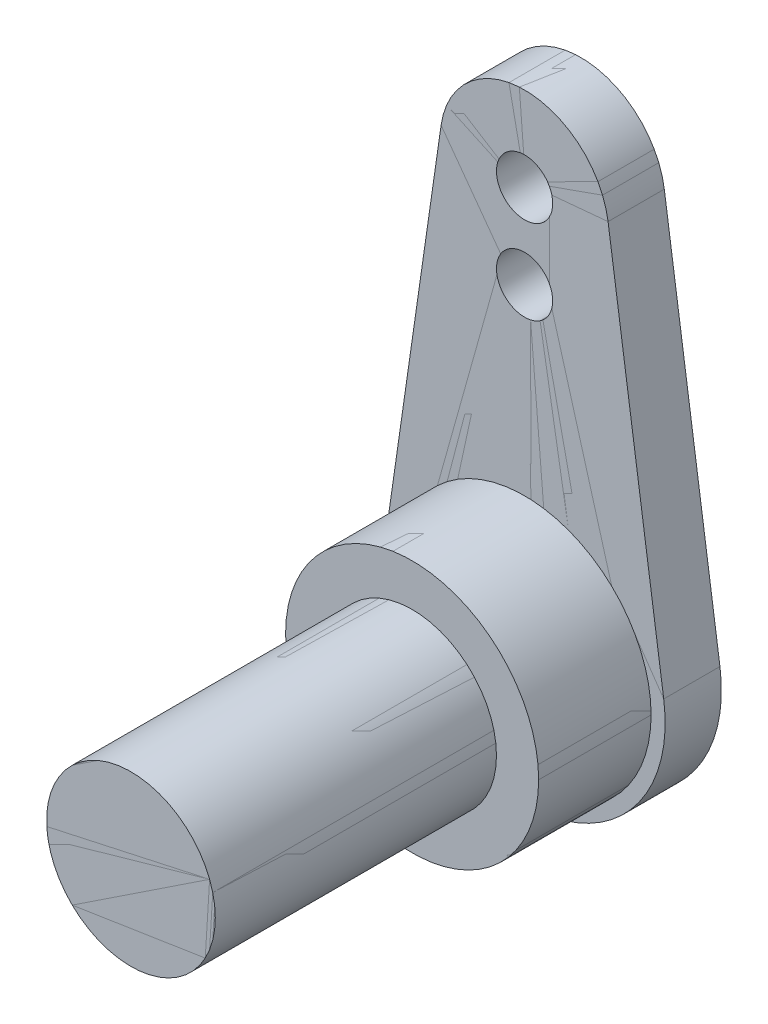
ISO-10303-21;
HEADER;
FILE_DESCRIPTION(('STEP AP214'),'2;1');
FILE_NAME('part.step','',(''),(''),'','','');
FILE_SCHEMA(('AUTOMOTIVE_DESIGN { 1 0 10303 214 1 1 1 1 }'));
ENDSEC;
DATA;
#1=APPLICATION_CONTEXT('core data for automotive mechanical design processes');
#2=APPLICATION_PROTOCOL_DEFINITION('international standard','automotive_design',2000,#1);
#3=PRODUCT_CONTEXT('',#1,'mechanical');
#4=PRODUCT('Part','Part','',(#3));
#5=PRODUCT_RELATED_PRODUCT_CATEGORY('part','',(#4));
#6=PRODUCT_DEFINITION_FORMATION('','',#4);
#7=PRODUCT_DEFINITION_CONTEXT('part definition',#1,'design');
#8=PRODUCT_DEFINITION('design','',#6,#7);
#9=PRODUCT_DEFINITION_SHAPE('','',#8);
#10=(LENGTH_UNIT() NAMED_UNIT(*) SI_UNIT(.MILLI.,.METRE.));
#11=(NAMED_UNIT(*) PLANE_ANGLE_UNIT() SI_UNIT($,.RADIAN.));
#12=(NAMED_UNIT(*) SI_UNIT($,.STERADIAN.) SOLID_ANGLE_UNIT());
#13=UNCERTAINTY_MEASURE_WITH_UNIT(LENGTH_MEASURE(1.E-05),#10,'distance_accuracy_value','');
#14=(GEOMETRIC_REPRESENTATION_CONTEXT(3) GLOBAL_UNCERTAINTY_ASSIGNED_CONTEXT((#13)) GLOBAL_UNIT_ASSIGNED_CONTEXT((#10,
#11,#12)) REPRESENTATION_CONTEXT('',''));
#15=CARTESIAN_POINT('',(0.,0.,0.));
#16=DIRECTION('',(0.,0.,1.));
#17=DIRECTION('',(1.,0.,0.));
#18=AXIS2_PLACEMENT_3D('',#15,#16,#17);
#19=CARTESIAN_POINT('',(-23.,-18.,14.));
#20=DIRECTION('',(0.,0.,1.));
#21=DIRECTION('',(1.,0.,0.));
#22=AXIS2_PLACEMENT_3D('',#19,#20,#21);
#23=PLANE('',#22);
#24=CARTESIAN_POINT('',(-20.,-15.,14.));
#25=DIRECTION('',(0.,0.,1.));
#26=DIRECTION('',(1.,0.,0.));
#27=AXIS2_PLACEMENT_3D('',#24,#25,#26);
#28=CIRCLE('',#27,3.);
#29=CARTESIAN_POINT('',(-17.,-15.,14.));
#30=VERTEX_POINT('',#29);
#31=EDGE_CURVE('P0_E458',#30,#30,#28,.T.);
#32=ORIENTED_EDGE('',*,*,#31,.T.);
#33=EDGE_LOOP('',(#32));
#34=FACE_BOUND('',#33,.T.);
#35=ADVANCED_FACE('P0_F350',(#34),#23,.T.);
#36=CARTESIAN_POINT('',(-20.,-15.,4.));
#37=DIRECTION('',(0.,0.,1.));
#38=DIRECTION('',(1.,0.,0.));
#39=AXIS2_PLACEMENT_3D('',#36,#37,#38);
#40=CYLINDRICAL_SURFACE('',#39,3.);
#41=CARTESIAN_POINT('',(-20.,-15.,4.));
#42=DIRECTION('',(0.,0.,1.));
#43=DIRECTION('',(1.,0.,0.));
#44=AXIS2_PLACEMENT_3D('',#41,#42,#43);
#45=CIRCLE('',#44,3.);
#46=CARTESIAN_POINT('',(-17.,-15.,4.));
#47=VERTEX_POINT('',#46);
#48=EDGE_CURVE('P0_E400',#47,#47,#45,.F.);
#49=ORIENTED_EDGE('',*,*,#48,.F.);
#50=EDGE_LOOP('',(#49));
#51=FACE_BOUND('',#50,.T.);
#52=ORIENTED_EDGE('',*,*,#31,.F.);
#53=EDGE_LOOP('',(#52));
#54=FACE_BOUND('',#53,.T.);
#55=ADVANCED_FACE('P0_F464',(#51,#54),#40,.T.);
#56=CARTESIAN_POINT('',(-24.5,-19.5,4.));
#57=DIRECTION('',(0.,0.,1.));
#58=DIRECTION('',(1.,0.,0.));
#59=AXIS2_PLACEMENT_3D('',#56,#57,#58);
#60=PLANE('',#59);
#61=ORIENTED_EDGE('',*,*,#48,.T.);
#62=EDGE_LOOP('',(#61));
#63=FACE_BOUND('',#62,.T.);
#64=CARTESIAN_POINT('',(-20.,-15.,4.));
#65=DIRECTION('',(0.,0.,1.));
#66=DIRECTION('',(1.,0.,0.));
#67=AXIS2_PLACEMENT_3D('',#64,#65,#66);
#68=CIRCLE('',#67,4.5);
#69=CARTESIAN_POINT('',(-15.5,-15.,4.));
#70=VERTEX_POINT('',#69);
#71=EDGE_CURVE('P0_E448',#70,#70,#68,.T.);
#72=ORIENTED_EDGE('',*,*,#71,.T.);
#73=EDGE_LOOP('',(#72));
#74=FACE_BOUND('',#73,.T.);
#75=ADVANCED_FACE('P0_F466',(#63,#74),#60,.T.);
#76=CARTESIAN_POINT('',(-14.2264973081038,-20.,-2.));
#77=DIRECTION('',(0.,0.,-1.));
#78=DIRECTION('',(-1.,0.,0.));
#79=AXIS2_PLACEMENT_3D('',#76,#77,#78);
#80=PLANE('',#79);
#81=CARTESIAN_POINT('',(-20.,-4.,-2.));
#82=DIRECTION('',(0.,0.,1.));
#83=DIRECTION('',(1.,0.,0.));
#84=AXIS2_PLACEMENT_3D('',#81,#82,#83);
#85=CIRCLE('',#84,1.);
#86=CARTESIAN_POINT('',(-19.,-4.,-2.));
#87=VERTEX_POINT('',#86);
#88=EDGE_CURVE('P0_E440',#87,#87,#85,.F.);
#89=ORIENTED_EDGE('',*,*,#88,.F.);
#90=EDGE_LOOP('',(#89));
#91=FACE_BOUND('',#90,.T.);
#92=CARTESIAN_POINT('',(-20.,-1.,-2.));
#93=DIRECTION('',(0.,0.,1.));
#94=DIRECTION('',(1.,0.,0.));
#95=AXIS2_PLACEMENT_3D('',#92,#93,#94);
#96=CIRCLE('',#95,1.);
#97=CARTESIAN_POINT('',(-19.,-1.,-2.));
#98=VERTEX_POINT('',#97);
#99=EDGE_CURVE('P0_E443',#98,#98,#96,.F.);
#100=ORIENTED_EDGE('',*,*,#99,.F.);
#101=EDGE_LOOP('',(#100));
#102=FACE_BOUND('',#101,.T.);
#103=DIRECTION('',(-0.142857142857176,0.989743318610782,0.));
#104=VECTOR('',#103,1.);
#105=CARTESIAN_POINT('',(-16.041026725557,-7.42857142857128,-2.00000000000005));
#106=LINE('',#105,#104);
#107=CARTESIAN_POINT('',(-15.051283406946,-14.2857142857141,-2.00000000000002));
#108=VERTEX_POINT('',#107);
#109=CARTESIAN_POINT('',(-17.0307700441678,-0.571428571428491,-2.));
#110=VERTEX_POINT('',#109);
#111=EDGE_CURVE('P0_E403',#108,#110,#106,.T.);
#112=ORIENTED_EDGE('',*,*,#111,.F.);
#113=CARTESIAN_POINT('',(-20.,-15.,-2.));
#114=DIRECTION('',(0.,0.,1.));
#115=DIRECTION('',(1.,0.,0.));
#116=AXIS2_PLACEMENT_3D('',#113,#114,#115);
#117=CIRCLE('',#116,5.);
#118=CARTESIAN_POINT('',(-24.948716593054,-14.2857142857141,-2.00000000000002));
#119=VERTEX_POINT('',#118);
#120=EDGE_CURVE('P0_E389',#108,#119,#117,.F.);
#121=ORIENTED_EDGE('',*,*,#120,.T.);
#122=DIRECTION('',(-0.142857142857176,-0.989743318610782,0.));
#123=VECTOR('',#122,1.);
#124=CARTESIAN_POINT('',(-23.958973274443,-7.42857142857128,-2.00000000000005));
#125=LINE('',#124,#123);
#126=CARTESIAN_POINT('',(-22.969229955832,-0.571428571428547,-2.00000000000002));
#127=VERTEX_POINT('',#126);
#128=EDGE_CURVE('P0_E418',#127,#119,#125,.T.);
#129=ORIENTED_EDGE('',*,*,#128,.F.);
#130=CARTESIAN_POINT('',(-20.,-1.,-2.));
#131=DIRECTION('',(0.,0.,1.));
#132=DIRECTION('',(1.,0.,0.));
#133=AXIS2_PLACEMENT_3D('',#130,#131,#132);
#134=CIRCLE('',#133,3.);
#135=EDGE_CURVE('P0_E405',#127,#110,#134,.F.);
#136=ORIENTED_EDGE('',*,*,#135,.T.);
#137=EDGE_LOOP('',(#112,#121,#129,#136));
#138=FACE_BOUND('',#137,.T.);
#139=ADVANCED_FACE('P0_F404',(#91,#102,#138),#80,.T.);
#140=CARTESIAN_POINT('',(-20.,-15.,-2.));
#141=DIRECTION('',(0.,0.,1.));
#142=DIRECTION('',(1.,0.,0.));
#143=AXIS2_PLACEMENT_3D('',#140,#141,#142);
#144=CYLINDRICAL_SURFACE('',#143,5.);
#145=DIRECTION('',(0.,0.,1.));
#146=VECTOR('',#145,1.);
#147=CARTESIAN_POINT('',(-24.948716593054,-14.285714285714,-6.9282032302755));
#148=LINE('',#147,#146);
#149=CARTESIAN_POINT('',(-24.948716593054,-14.2857142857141,0.));
#150=VERTEX_POINT('',#149);
#151=EDGE_CURVE('P0_E396',#119,#150,#148,.T.);
#152=ORIENTED_EDGE('',*,*,#151,.F.);
#153=ORIENTED_EDGE('',*,*,#120,.F.);
#154=DIRECTION('',(0.,0.,-1.));
#155=VECTOR('',#154,1.);
#156=CARTESIAN_POINT('',(-15.051283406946,-14.285714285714,-6.9282032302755));
#157=LINE('',#156,#155);
#158=CARTESIAN_POINT('',(-15.051283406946,-14.2857142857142,0.));
#159=VERTEX_POINT('',#158);
#160=EDGE_CURVE('P0_E393',#159,#108,#157,.T.);
#161=ORIENTED_EDGE('',*,*,#160,.F.);
#162=CARTESIAN_POINT('',(-20.,-15.,0.));
#163=DIRECTION('',(0.,0.,1.));
#164=DIRECTION('',(1.,0.,0.));
#165=AXIS2_PLACEMENT_3D('',#162,#163,#164);
#166=CIRCLE('',#165,5.);
#167=EDGE_CURVE('P0_E438',#150,#159,#166,.T.);
#168=ORIENTED_EDGE('',*,*,#167,.F.);
#169=EDGE_LOOP('',(#152,#153,#161,#168));
#170=FACE_BOUND('',#169,.T.);
#171=ADVANCED_FACE('P0_F391',(#170),#144,.T.);
#172=CARTESIAN_POINT('',(-15.051283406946,-14.285714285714,0.));
#173=DIRECTION('',(0.989743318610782,0.142857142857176,0.));
#174=DIRECTION('',(0.,0.,-1.));
#175=AXIS2_PLACEMENT_3D('',#172,#173,#174);
#176=PLANE('',#175);
#177=ORIENTED_EDGE('',*,*,#111,.T.);
#178=DIRECTION('',(0.,0.,1.));
#179=VECTOR('',#178,1.);
#180=CARTESIAN_POINT('',(-17.0307700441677,-0.571428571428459,-1.));
#181=LINE('',#180,#179);
#182=CARTESIAN_POINT('',(-17.0307700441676,-0.571428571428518,0.));
#183=VERTEX_POINT('',#182);
#184=EDGE_CURVE('P0_E416',#110,#183,#181,.T.);
#185=ORIENTED_EDGE('',*,*,#184,.T.);
#186=DIRECTION('',(-0.142857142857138,0.989743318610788,0.));
#187=VECTOR('',#186,1.);
#188=CARTESIAN_POINT('',(-15.0512834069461,-14.2857142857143,0.));
#189=LINE('',#188,#187);
#190=EDGE_CURVE('P0_E411',#159,#183,#189,.T.);
#191=ORIENTED_EDGE('',*,*,#190,.F.);
#192=ORIENTED_EDGE('',*,*,#160,.T.);
#193=EDGE_LOOP('',(#177,#185,#191,#192));
#194=FACE_BOUND('',#193,.T.);
#195=ADVANCED_FACE('P0_F409',(#194),#176,.T.);
#196=CARTESIAN_POINT('',(-20.,-1.,-2.));
#197=DIRECTION('',(0.,0.,1.));
#198=DIRECTION('',(1.,0.,0.));
#199=AXIS2_PLACEMENT_3D('',#196,#197,#198);
#200=CYLINDRICAL_SURFACE('',#199,3.);
#201=ORIENTED_EDGE('',*,*,#184,.F.);
#202=ORIENTED_EDGE('',*,*,#135,.F.);
#203=DIRECTION('',(0.,0.,-1.));
#204=VECTOR('',#203,1.);
#205=CARTESIAN_POINT('',(-22.969229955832,-0.57142857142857,-6.9282032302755));
#206=LINE('',#205,#204);
#207=CARTESIAN_POINT('',(-22.9692299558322,-0.571428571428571,0.));
#208=VERTEX_POINT('',#207);
#209=EDGE_CURVE('P0_E369',#208,#127,#206,.T.);
#210=ORIENTED_EDGE('',*,*,#209,.F.);
#211=CARTESIAN_POINT('',(-20.,-1.,0.));
#212=DIRECTION('',(0.,0.,1.));
#213=DIRECTION('',(1.,0.,0.));
#214=AXIS2_PLACEMENT_3D('',#211,#212,#213);
#215=CIRCLE('',#214,3.);
#216=EDGE_CURVE('P0_E434',#183,#208,#215,.T.);
#217=ORIENTED_EDGE('',*,*,#216,.F.);
#218=EDGE_LOOP('',(#201,#202,#210,#217));
#219=FACE_BOUND('',#218,.T.);
#220=ADVANCED_FACE('P0_F493',(#219),#200,.T.);
#221=CARTESIAN_POINT('',(-22.969229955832,-0.57142857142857,0.));
#222=DIRECTION('',(-0.989743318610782,0.142857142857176,0.));
#223=DIRECTION('',(0.,0.,-1.));
#224=AXIS2_PLACEMENT_3D('',#221,#222,#223);
#225=PLANE('',#224);
#226=ORIENTED_EDGE('',*,*,#128,.T.);
#227=ORIENTED_EDGE('',*,*,#151,.T.);
#228=DIRECTION('',(-0.142857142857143,-0.989743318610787,0.));
#229=VECTOR('',#228,1.);
#230=CARTESIAN_POINT('',(-22.9692299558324,-0.571428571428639,0.));
#231=LINE('',#230,#229);
#232=EDGE_CURVE('P0_E429',#208,#150,#231,.T.);
#233=ORIENTED_EDGE('',*,*,#232,.F.);
#234=ORIENTED_EDGE('',*,*,#209,.T.);
#235=EDGE_LOOP('',(#226,#227,#233,#234));
#236=FACE_BOUND('',#235,.T.);
#237=ADVANCED_FACE('P0_F496',(#236),#225,.T.);
#238=CARTESIAN_POINT('',(-20.,-15.,0.));
#239=DIRECTION('',(0.,0.,1.));
#240=DIRECTION('',(1.,0.,0.));
#241=AXIS2_PLACEMENT_3D('',#238,#239,#240);
#242=CYLINDRICAL_SURFACE('',#241,4.5);
#243=CARTESIAN_POINT('',(-20.,-15.,0.));
#244=DIRECTION('',(0.,0.,1.));
#245=DIRECTION('',(1.,0.,0.));
#246=AXIS2_PLACEMENT_3D('',#243,#244,#245);
#247=CIRCLE('',#246,4.5);
#248=CARTESIAN_POINT('',(-15.5,-15.,0.));
#249=VERTEX_POINT('',#248);
#250=EDGE_CURVE('P0_E424',#249,#249,#247,.F.);
#251=ORIENTED_EDGE('',*,*,#250,.F.);
#252=EDGE_LOOP('',(#251));
#253=FACE_BOUND('',#252,.T.);
#254=ORIENTED_EDGE('',*,*,#71,.F.);
#255=EDGE_LOOP('',(#254));
#256=FACE_BOUND('',#255,.T.);
#257=ADVANCED_FACE('P0_F498',(#253,#256),#242,.T.);
#258=CARTESIAN_POINT('',(-20.,-1.,-2.));
#259=DIRECTION('',(0.,0.,1.));
#260=DIRECTION('',(1.,0.,0.));
#261=AXIS2_PLACEMENT_3D('',#258,#259,#260);
#262=CYLINDRICAL_SURFACE('',#261,1.);
#263=ORIENTED_EDGE('',*,*,#99,.T.);
#264=EDGE_LOOP('',(#263));
#265=FACE_BOUND('',#264,.T.);
#266=CARTESIAN_POINT('',(-20.,-1.,0.));
#267=DIRECTION('',(0.,0.,1.));
#268=DIRECTION('',(1.,0.,0.));
#269=AXIS2_PLACEMENT_3D('',#266,#267,#268);
#270=CIRCLE('',#269,1.);
#271=CARTESIAN_POINT('',(-19.,-1.,0.));
#272=VERTEX_POINT('',#271);
#273=EDGE_CURVE('P0_E360',#272,#272,#270,.F.);
#274=ORIENTED_EDGE('',*,*,#273,.F.);
#275=EDGE_LOOP('',(#274));
#276=FACE_BOUND('',#275,.T.);
#277=ADVANCED_FACE('P0_F484',(#265,#276),#262,.F.);
#278=CARTESIAN_POINT('',(-20.,-4.,-2.));
#279=DIRECTION('',(0.,0.,1.));
#280=DIRECTION('',(1.,0.,0.));
#281=AXIS2_PLACEMENT_3D('',#278,#279,#280);
#282=CYLINDRICAL_SURFACE('',#281,1.);
#283=ORIENTED_EDGE('',*,*,#88,.T.);
#284=EDGE_LOOP('',(#283));
#285=FACE_BOUND('',#284,.T.);
#286=CARTESIAN_POINT('',(-20.,-4.,0.));
#287=DIRECTION('',(0.,0.,1.));
#288=DIRECTION('',(1.,0.,0.));
#289=AXIS2_PLACEMENT_3D('',#286,#287,#288);
#290=CIRCLE('',#289,1.);
#291=CARTESIAN_POINT('',(-19.,-4.,0.));
#292=VERTEX_POINT('',#291);
#293=EDGE_CURVE('P0_E11',#292,#292,#290,.F.);
#294=ORIENTED_EDGE('',*,*,#293,.F.);
#295=EDGE_LOOP('',(#294));
#296=FACE_BOUND('',#295,.T.);
#297=ADVANCED_FACE('P0_F479',(#285,#296),#282,.F.);
#298=CARTESIAN_POINT('',(-25.7735026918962,-20.,0.));
#299=DIRECTION('',(0.,0.,1.));
#300=DIRECTION('',(1.,0.,0.));
#301=AXIS2_PLACEMENT_3D('',#298,#299,#300);
#302=PLANE('',#301);
#303=ORIENTED_EDGE('',*,*,#293,.T.);
#304=EDGE_LOOP('',(#303));
#305=FACE_BOUND('',#304,.T.);
#306=ORIENTED_EDGE('',*,*,#273,.T.);
#307=EDGE_LOOP('',(#306));
#308=FACE_BOUND('',#307,.T.);
#309=ORIENTED_EDGE('',*,*,#250,.T.);
#310=EDGE_LOOP('',(#309));
#311=FACE_BOUND('',#310,.T.);
#312=ORIENTED_EDGE('',*,*,#216,.T.);
#313=ORIENTED_EDGE('',*,*,#232,.T.);
#314=ORIENTED_EDGE('',*,*,#167,.T.);
#315=ORIENTED_EDGE('',*,*,#190,.T.);
#316=EDGE_LOOP('',(#312,#313,#314,#315));
#317=FACE_BOUND('',#316,.T.);
#318=ADVANCED_FACE('P0_F352',(#305,#308,#311,#317),#302,.T.);
#319=CLOSED_SHELL('',(#35,#55,#75,#139,#171,#195,#220,#237,#257,#277,#297,#318));
#320=MANIFOLD_SOLID_BREP('P0_B2',#319);
#321=CARTESIAN_POINT('',(-23.,-18.,14.));
#322=DIRECTION('',(0.,0.,1.));
#323=DIRECTION('',(1.,0.,0.));
#324=AXIS2_PLACEMENT_3D('',#321,#322,#323);
#325=PLANE('',#324);
#326=CARTESIAN_POINT('',(-20.,-15.,14.));
#327=DIRECTION('',(0.,0.,1.));
#328=DIRECTION('',(1.,0.,0.));
#329=AXIS2_PLACEMENT_3D('',#326,#327,#328);
#330=CIRCLE('',#329,3.);
#331=CARTESIAN_POINT('',(-17.,-15.,14.));
#332=VERTEX_POINT('',#331);
#333=EDGE_CURVE('P1_E123',#332,#332,#330,.T.);
#334=ORIENTED_EDGE('',*,*,#333,.T.);
#335=EDGE_LOOP('',(#334));
#336=FACE_BOUND('',#335,.T.);
#337=ADVANCED_FACE('P1_F15',(#336),#325,.T.);
#338=CARTESIAN_POINT('',(-20.,-15.,4.));
#339=DIRECTION('',(0.,0.,1.));
#340=DIRECTION('',(1.,0.,0.));
#341=AXIS2_PLACEMENT_3D('',#338,#339,#340);
#342=CYLINDRICAL_SURFACE('',#341,3.);
#343=CARTESIAN_POINT('',(-20.,-15.,4.));
#344=DIRECTION('',(0.,0.,1.));
#345=DIRECTION('',(1.,0.,0.));
#346=AXIS2_PLACEMENT_3D('',#343,#344,#345);
#347=CIRCLE('',#346,3.);
#348=CARTESIAN_POINT('',(-17.,-15.,4.));
#349=VERTEX_POINT('',#348);
#350=EDGE_CURVE('P1_E65',#349,#349,#347,.F.);
#351=ORIENTED_EDGE('',*,*,#350,.F.);
#352=EDGE_LOOP('',(#351));
#353=FACE_BOUND('',#352,.T.);
#354=ORIENTED_EDGE('',*,*,#333,.F.);
#355=EDGE_LOOP('',(#354));
#356=FACE_BOUND('',#355,.T.);
#357=ADVANCED_FACE('P1_F129',(#353,#356),#342,.T.);
#358=CARTESIAN_POINT('',(-24.5,-19.5,4.));
#359=DIRECTION('',(0.,0.,1.));
#360=DIRECTION('',(1.,0.,0.));
#361=AXIS2_PLACEMENT_3D('',#358,#359,#360);
#362=PLANE('',#361);
#363=ORIENTED_EDGE('',*,*,#350,.T.);
#364=EDGE_LOOP('',(#363));
#365=FACE_BOUND('',#364,.T.);
#366=CARTESIAN_POINT('',(-20.,-15.,4.));
#367=DIRECTION('',(0.,0.,1.));
#368=DIRECTION('',(1.,0.,0.));
#369=AXIS2_PLACEMENT_3D('',#366,#367,#368);
#370=CIRCLE('',#369,4.5);
#371=CARTESIAN_POINT('',(-15.5,-15.,4.));
#372=VERTEX_POINT('',#371);
#373=EDGE_CURVE('P1_E113',#372,#372,#370,.T.);
#374=ORIENTED_EDGE('',*,*,#373,.T.);
#375=EDGE_LOOP('',(#374));
#376=FACE_BOUND('',#375,.T.);
#377=ADVANCED_FACE('P1_F130',(#365,#376),#362,.T.);
#378=CARTESIAN_POINT('',(-14.2264973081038,-20.,-2.));
#379=DIRECTION('',(0.,0.,-1.));
#380=DIRECTION('',(-1.,0.,0.));
#381=AXIS2_PLACEMENT_3D('',#378,#379,#380);
#382=PLANE('',#381);
#383=CARTESIAN_POINT('',(-20.,-4.,-2.));
#384=DIRECTION('',(0.,0.,1.));
#385=DIRECTION('',(1.,0.,0.));
#386=AXIS2_PLACEMENT_3D('',#383,#384,#385);
#387=CIRCLE('',#386,1.);
#388=CARTESIAN_POINT('',(-19.,-4.,-2.));
#389=VERTEX_POINT('',#388);
#390=EDGE_CURVE('P1_E105',#389,#389,#387,.F.);
#391=ORIENTED_EDGE('',*,*,#390,.F.);
#392=EDGE_LOOP('',(#391));
#393=FACE_BOUND('',#392,.T.);
#394=CARTESIAN_POINT('',(-20.,-1.,-2.));
#395=DIRECTION('',(0.,0.,1.));
#396=DIRECTION('',(1.,0.,0.));
#397=AXIS2_PLACEMENT_3D('',#394,#395,#396);
#398=CIRCLE('',#397,1.);
#399=CARTESIAN_POINT('',(-19.,-1.,-2.));
#400=VERTEX_POINT('',#399);
#401=EDGE_CURVE('P1_E108',#400,#400,#398,.F.);
#402=ORIENTED_EDGE('',*,*,#401,.F.);
#403=EDGE_LOOP('',(#402));
#404=FACE_BOUND('',#403,.T.);
#405=DIRECTION('',(-0.142857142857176,0.989743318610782,0.));
#406=VECTOR('',#405,1.);
#407=CARTESIAN_POINT('',(-16.041026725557,-7.42857142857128,-2.00000000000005));
#408=LINE('',#407,#406);
#409=CARTESIAN_POINT('',(-15.051283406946,-14.2857142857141,-2.00000000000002));
#410=VERTEX_POINT('',#409);
#411=CARTESIAN_POINT('',(-17.0307700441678,-0.571428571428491,-2.));
#412=VERTEX_POINT('',#411);
#413=EDGE_CURVE('P1_E68',#410,#412,#408,.T.);
#414=ORIENTED_EDGE('',*,*,#413,.F.);
#415=CARTESIAN_POINT('',(-20.,-15.,-2.));
#416=DIRECTION('',(0.,0.,1.));
#417=DIRECTION('',(1.,0.,0.));
#418=AXIS2_PLACEMENT_3D('',#415,#416,#417);
#419=CIRCLE('',#418,5.);
#420=CARTESIAN_POINT('',(-24.948716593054,-14.2857142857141,-2.00000000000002));
#421=VERTEX_POINT('',#420);
#422=EDGE_CURVE('P1_E54',#410,#421,#419,.F.);
#423=ORIENTED_EDGE('',*,*,#422,.T.);
#424=DIRECTION('',(-0.142857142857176,-0.989743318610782,0.));
#425=VECTOR('',#424,1.);
#426=CARTESIAN_POINT('',(-23.958973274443,-7.42857142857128,-2.00000000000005));
#427=LINE('',#426,#425);
#428=CARTESIAN_POINT('',(-22.969229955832,-0.571428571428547,-2.00000000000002));
#429=VERTEX_POINT('',#428);
#430=EDGE_CURVE('P1_E83',#429,#421,#427,.T.);
#431=ORIENTED_EDGE('',*,*,#430,.F.);
#432=CARTESIAN_POINT('',(-20.,-1.,-2.));
#433=DIRECTION('',(0.,0.,1.));
#434=DIRECTION('',(1.,0.,0.));
#435=AXIS2_PLACEMENT_3D('',#432,#433,#434);
#436=CIRCLE('',#435,3.);
#437=EDGE_CURVE('P1_E70',#429,#412,#436,.F.);
#438=ORIENTED_EDGE('',*,*,#437,.T.);
#439=EDGE_LOOP('',(#414,#423,#431,#438));
#440=FACE_BOUND('',#439,.T.);
#441=ADVANCED_FACE('P1_F69',(#393,#404,#440),#382,.T.);
#442=CARTESIAN_POINT('',(-20.,-15.,-2.));
#443=DIRECTION('',(0.,0.,1.));
#444=DIRECTION('',(1.,0.,0.));
#445=AXIS2_PLACEMENT_3D('',#442,#443,#444);
#446=CYLINDRICAL_SURFACE('',#445,5.);
#447=DIRECTION('',(0.,0.,1.));
#448=VECTOR('',#447,1.);
#449=CARTESIAN_POINT('',(-24.948716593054,-14.285714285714,-6.9282032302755));
#450=LINE('',#449,#448);
#451=CARTESIAN_POINT('',(-24.948716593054,-14.2857142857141,0.));
#452=VERTEX_POINT('',#451);
#453=EDGE_CURVE('P1_E61',#421,#452,#450,.T.);
#454=ORIENTED_EDGE('',*,*,#453,.F.);
#455=ORIENTED_EDGE('',*,*,#422,.F.);
#456=DIRECTION('',(0.,0.,-1.));
#457=VECTOR('',#456,1.);
#458=CARTESIAN_POINT('',(-15.051283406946,-14.285714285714,-6.9282032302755));
#459=LINE('',#458,#457);
#460=CARTESIAN_POINT('',(-15.051283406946,-14.2857142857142,0.));
#461=VERTEX_POINT('',#460);
#462=EDGE_CURVE('P1_E58',#461,#410,#459,.T.);
#463=ORIENTED_EDGE('',*,*,#462,.F.);
#464=CARTESIAN_POINT('',(-20.,-15.,0.));
#465=DIRECTION('',(0.,0.,1.));
#466=DIRECTION('',(1.,0.,0.));
#467=AXIS2_PLACEMENT_3D('',#464,#465,#466);
#468=CIRCLE('',#467,5.);
#469=EDGE_CURVE('P1_E103',#452,#461,#468,.T.);
#470=ORIENTED_EDGE('',*,*,#469,.F.);
#471=EDGE_LOOP('',(#454,#455,#463,#470));
#472=FACE_BOUND('',#471,.T.);
#473=ADVANCED_FACE('P1_F56',(#472),#446,.T.);
#474=CARTESIAN_POINT('',(-15.051283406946,-14.285714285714,0.));
#475=DIRECTION('',(0.989743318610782,0.142857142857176,0.));
#476=DIRECTION('',(0.,0.,-1.));
#477=AXIS2_PLACEMENT_3D('',#474,#475,#476);
#478=PLANE('',#477);
#479=ORIENTED_EDGE('',*,*,#413,.T.);
#480=DIRECTION('',(0.,0.,1.));
#481=VECTOR('',#480,1.);
#482=CARTESIAN_POINT('',(-17.0307700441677,-0.571428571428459,-1.));
#483=LINE('',#482,#481);
#484=CARTESIAN_POINT('',(-17.0307700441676,-0.571428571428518,0.));
#485=VERTEX_POINT('',#484);
#486=EDGE_CURVE('P1_E81',#412,#485,#483,.T.);
#487=ORIENTED_EDGE('',*,*,#486,.T.);
#488=DIRECTION('',(-0.142857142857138,0.989743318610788,0.));
#489=VECTOR('',#488,1.);
#490=CARTESIAN_POINT('',(-15.0512834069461,-14.2857142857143,0.));
#491=LINE('',#490,#489);
#492=EDGE_CURVE('P1_E76',#461,#485,#491,.T.);
#493=ORIENTED_EDGE('',*,*,#492,.F.);
#494=ORIENTED_EDGE('',*,*,#462,.T.);
#495=EDGE_LOOP('',(#479,#487,#493,#494));
#496=FACE_BOUND('',#495,.T.);
#497=ADVANCED_FACE('P1_F74',(#496),#478,.T.);
#498=CARTESIAN_POINT('',(-20.,-1.,-2.));
#499=DIRECTION('',(0.,0.,1.));
#500=DIRECTION('',(1.,0.,0.));
#501=AXIS2_PLACEMENT_3D('',#498,#499,#500);
#502=CYLINDRICAL_SURFACE('',#501,3.);
#503=ORIENTED_EDGE('',*,*,#486,.F.);
#504=ORIENTED_EDGE('',*,*,#437,.F.);
#505=DIRECTION('',(0.,0.,-1.));
#506=VECTOR('',#505,1.);
#507=CARTESIAN_POINT('',(-22.969229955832,-0.57142857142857,-6.9282032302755));
#508=LINE('',#507,#506);
#509=CARTESIAN_POINT('',(-22.9692299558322,-0.571428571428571,0.));
#510=VERTEX_POINT('',#509);
#511=EDGE_CURVE('P1_E34',#510,#429,#508,.T.);
#512=ORIENTED_EDGE('',*,*,#511,.F.);
#513=CARTESIAN_POINT('',(-20.,-1.,0.));
#514=DIRECTION('',(0.,0.,1.));
#515=DIRECTION('',(1.,0.,0.));
#516=AXIS2_PLACEMENT_3D('',#513,#514,#515);
#517=CIRCLE('',#516,3.);
#518=EDGE_CURVE('P1_E99',#485,#510,#517,.T.);
#519=ORIENTED_EDGE('',*,*,#518,.F.);
#520=EDGE_LOOP('',(#503,#504,#512,#519));
#521=FACE_BOUND('',#520,.T.);
#522=ADVANCED_FACE('P1_F149',(#521),#502,.T.);
#523=CARTESIAN_POINT('',(-22.969229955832,-0.57142857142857,0.));
#524=DIRECTION('',(-0.989743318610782,0.142857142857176,0.));
#525=DIRECTION('',(0.,0.,-1.));
#526=AXIS2_PLACEMENT_3D('',#523,#524,#525);
#527=PLANE('',#526);
#528=ORIENTED_EDGE('',*,*,#430,.T.);
#529=ORIENTED_EDGE('',*,*,#453,.T.);
#530=DIRECTION('',(-0.142857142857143,-0.989743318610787,0.));
#531=VECTOR('',#530,1.);
#532=CARTESIAN_POINT('',(-22.9692299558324,-0.571428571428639,0.));
#533=LINE('',#532,#531);
#534=EDGE_CURVE('P1_E94',#510,#452,#533,.T.);
#535=ORIENTED_EDGE('',*,*,#534,.F.);
#536=ORIENTED_EDGE('',*,*,#511,.T.);
#537=EDGE_LOOP('',(#528,#529,#535,#536));
#538=FACE_BOUND('',#537,.T.);
#539=ADVANCED_FACE('P1_F152',(#538),#527,.T.);
#540=CARTESIAN_POINT('',(-20.,-15.,0.));
#541=DIRECTION('',(0.,0.,1.));
#542=DIRECTION('',(1.,0.,0.));
#543=AXIS2_PLACEMENT_3D('',#540,#541,#542);
#544=CYLINDRICAL_SURFACE('',#543,4.5);
#545=CARTESIAN_POINT('',(-20.,-15.,0.));
#546=DIRECTION('',(0.,0.,1.));
#547=DIRECTION('',(1.,0.,0.));
#548=AXIS2_PLACEMENT_3D('',#545,#546,#547);
#549=CIRCLE('',#548,4.5);
#550=CARTESIAN_POINT('',(-15.5,-15.,0.));
#551=VERTEX_POINT('',#550);
#552=EDGE_CURVE('P1_E89',#551,#551,#549,.F.);
#553=ORIENTED_EDGE('',*,*,#552,.F.);
#554=EDGE_LOOP('',(#553));
#555=FACE_BOUND('',#554,.T.);
#556=ORIENTED_EDGE('',*,*,#373,.F.);
#557=EDGE_LOOP('',(#556));
#558=FACE_BOUND('',#557,.T.);
#559=ADVANCED_FACE('P1_F153',(#555,#558),#544,.T.);
#560=CARTESIAN_POINT('',(-20.,-1.,-2.));
#561=DIRECTION('',(0.,0.,1.));
#562=DIRECTION('',(1.,0.,0.));
#563=AXIS2_PLACEMENT_3D('',#560,#561,#562);
#564=CYLINDRICAL_SURFACE('',#563,1.);
#565=ORIENTED_EDGE('',*,*,#401,.T.);
#566=EDGE_LOOP('',(#565));
#567=FACE_BOUND('',#566,.T.);
#568=CARTESIAN_POINT('',(-20.,-1.,0.));
#569=DIRECTION('',(0.,0.,1.));
#570=DIRECTION('',(1.,0.,0.));
#571=AXIS2_PLACEMENT_3D('',#568,#569,#570);
#572=CIRCLE('',#571,1.);
#573=CARTESIAN_POINT('',(-19.,-1.,0.));
#574=VERTEX_POINT('',#573);
#575=EDGE_CURVE('P1_E25',#574,#574,#572,.F.);
#576=ORIENTED_EDGE('',*,*,#575,.F.);
#577=EDGE_LOOP('',(#576));
#578=FACE_BOUND('',#577,.T.);
#579=ADVANCED_FACE('P1_F140',(#567,#578),#564,.F.);
#580=CARTESIAN_POINT('',(-20.,-4.,-2.));
#581=DIRECTION('',(0.,0.,1.));
#582=DIRECTION('',(1.,0.,0.));
#583=AXIS2_PLACEMENT_3D('',#580,#581,#582);
#584=CYLINDRICAL_SURFACE('',#583,1.);
#585=ORIENTED_EDGE('',*,*,#390,.T.);
#586=EDGE_LOOP('',(#585));
#587=FACE_BOUND('',#586,.T.);
#588=CARTESIAN_POINT('',(-20.,-4.,0.));
#589=DIRECTION('',(0.,0.,1.));
#590=DIRECTION('',(1.,0.,0.));
#591=AXIS2_PLACEMENT_3D('',#588,#589,#590);
#592=CIRCLE('',#591,1.);
#593=CARTESIAN_POINT('',(-19.,-4.,0.));
#594=VERTEX_POINT('',#593);
#595=EDGE_CURVE('P1_E10',#594,#594,#592,.F.);
#596=ORIENTED_EDGE('',*,*,#595,.F.);
#597=EDGE_LOOP('',(#596));
#598=FACE_BOUND('',#597,.T.);
#599=ADVANCED_FACE('P1_F138',(#587,#598),#584,.F.);
#600=CARTESIAN_POINT('',(-25.7735026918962,-20.,0.));
#601=DIRECTION('',(0.,0.,1.));
#602=DIRECTION('',(1.,0.,0.));
#603=AXIS2_PLACEMENT_3D('',#600,#601,#602);
#604=PLANE('',#603);
#605=ORIENTED_EDGE('',*,*,#595,.T.);
#606=EDGE_LOOP('',(#605));
#607=FACE_BOUND('',#606,.T.);
#608=ORIENTED_EDGE('',*,*,#575,.T.);
#609=EDGE_LOOP('',(#608));
#610=FACE_BOUND('',#609,.T.);
#611=ORIENTED_EDGE('',*,*,#552,.T.);
#612=EDGE_LOOP('',(#611));
#613=FACE_BOUND('',#612,.T.);
#614=ORIENTED_EDGE('',*,*,#518,.T.);
#615=ORIENTED_EDGE('',*,*,#534,.T.);
#616=ORIENTED_EDGE('',*,*,#469,.T.);
#617=ORIENTED_EDGE('',*,*,#492,.T.);
#618=EDGE_LOOP('',(#614,#615,#616,#617));
#619=FACE_BOUND('',#618,.T.);
#620=ADVANCED_FACE('P1_F17',(#607,#610,#613,#619),#604,.T.);
#621=CLOSED_SHELL('',(#337,#357,#377,#441,#473,#497,#522,#539,#559,#579,#599,#620));
#622=MANIFOLD_SOLID_BREP('P1_B1',#621);
#623=ADVANCED_BREP_SHAPE_REPRESENTATION('',(#18,#320,#622),#14);
#624=SHAPE_DEFINITION_REPRESENTATION(#9,#623);
ENDSEC;
END-ISO-10303-21;
